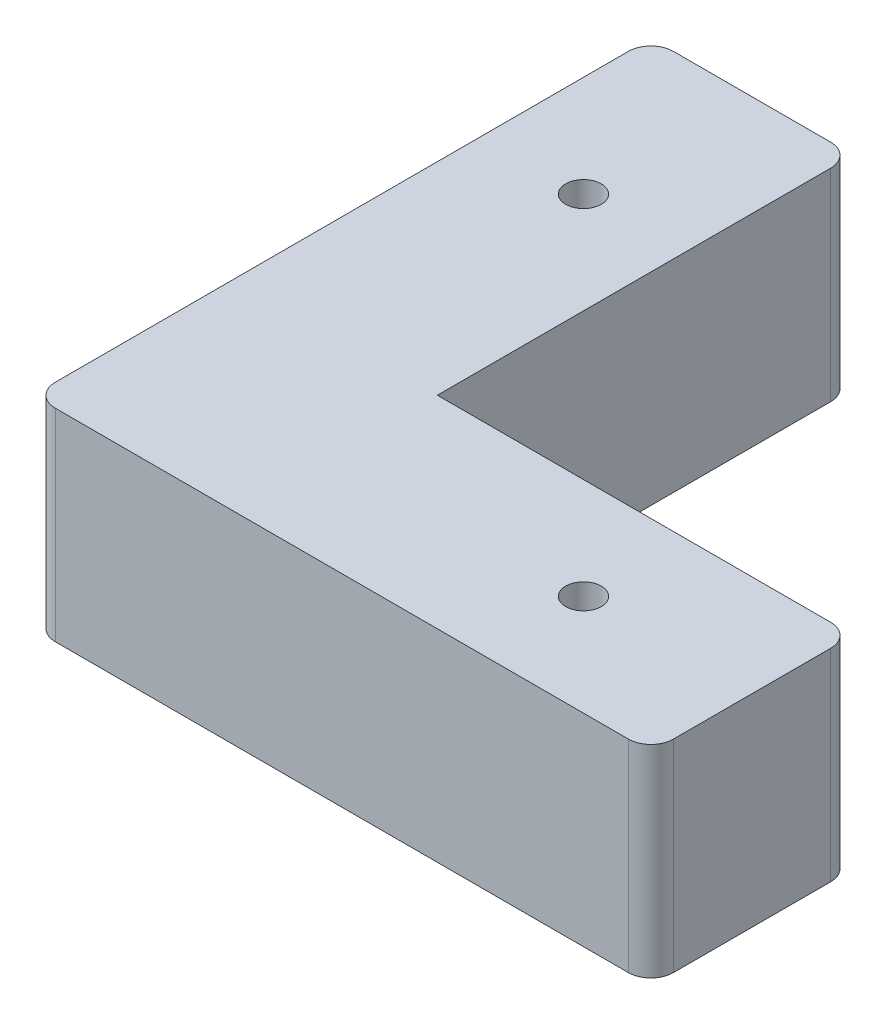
ISO-10303-21;
HEADER;
FILE_DESCRIPTION(('STEP AP214'),'2;1');
FILE_NAME('part.step','',(''),(''),'','','');
FILE_SCHEMA(('AUTOMOTIVE_DESIGN { 1 0 10303 214 1 1 1 1 }'));
ENDSEC;
DATA;
#1=APPLICATION_CONTEXT('core data for automotive mechanical design processes');
#2=APPLICATION_PROTOCOL_DEFINITION('international standard','automotive_design',2000,#1);
#3=PRODUCT_CONTEXT('',#1,'mechanical');
#4=PRODUCT('Part','Part','',(#3));
#5=PRODUCT_RELATED_PRODUCT_CATEGORY('part','',(#4));
#6=PRODUCT_DEFINITION_FORMATION('','',#4);
#7=PRODUCT_DEFINITION_CONTEXT('part definition',#1,'design');
#8=PRODUCT_DEFINITION('design','',#6,#7);
#9=PRODUCT_DEFINITION_SHAPE('','',#8);
#10=(LENGTH_UNIT() NAMED_UNIT(*) SI_UNIT(.MILLI.,.METRE.));
#11=(NAMED_UNIT(*) PLANE_ANGLE_UNIT() SI_UNIT($,.RADIAN.));
#12=(NAMED_UNIT(*) SI_UNIT($,.STERADIAN.) SOLID_ANGLE_UNIT());
#13=UNCERTAINTY_MEASURE_WITH_UNIT(LENGTH_MEASURE(1.E-05),#10,'distance_accuracy_value','');
#14=(GEOMETRIC_REPRESENTATION_CONTEXT(3) GLOBAL_UNCERTAINTY_ASSIGNED_CONTEXT((#13)) GLOBAL_UNIT_ASSIGNED_CONTEXT((#10,
#11,#12)) REPRESENTATION_CONTEXT('',''));
#15=CARTESIAN_POINT('',(0.,0.,0.));
#16=DIRECTION('',(0.,0.,1.));
#17=DIRECTION('',(1.,0.,0.));
#18=AXIS2_PLACEMENT_3D('',#15,#16,#17);
#19=CARTESIAN_POINT('',(0.,9.,0.));
#20=DIRECTION('',(0.,1.,0.));
#21=DIRECTION('',(0.,0.,1.));
#22=AXIS2_PLACEMENT_3D('',#19,#20,#21);
#23=PLANE('',#22);
#24=CARTESIAN_POINT('',(9.,9.,-40.));
#25=DIRECTION('',(0.,1.,0.));
#26=DIRECTION('',(0.,0.,1.));
#27=AXIS2_PLACEMENT_3D('',#24,#25,#26);
#28=CIRCLE('',#27,1.585);
#29=CARTESIAN_POINT('',(9.,9.,-38.415));
#30=VERTEX_POINT('',#29);
#31=EDGE_CURVE('E142',#30,#30,#28,.T.);
#32=ORIENTED_EDGE('',*,*,#31,.F.);
#33=EDGE_LOOP('',(#32));
#34=FACE_BOUND('',#33,.T.);
#35=DIRECTION('',(-1.,0.,0.));
#36=VECTOR('',#35,1.);
#37=CARTESIAN_POINT('',(18.,9.,-55.));
#38=LINE('',#37,#36);
#39=CARTESIAN_POINT('',(16.,9.,-55.));
#40=VERTEX_POINT('',#39);
#41=CARTESIAN_POINT('',(2.,9.,-55.));
#42=VERTEX_POINT('',#41);
#43=EDGE_CURVE('E153',#40,#42,#38,.T.);
#44=ORIENTED_EDGE('',*,*,#43,.T.);
#45=CARTESIAN_POINT('',(2.,9.,-53.));
#46=DIRECTION('',(0.,1.,0.));
#47=DIRECTION('',(0.,0.,1.));
#48=AXIS2_PLACEMENT_3D('',#45,#46,#47);
#49=CIRCLE('',#48,2.);
#50=CARTESIAN_POINT('',(0.,9.,-53.));
#51=VERTEX_POINT('',#50);
#52=EDGE_CURVE('E181',#42,#51,#49,.T.);
#53=ORIENTED_EDGE('',*,*,#52,.T.);
#54=DIRECTION('',(0.,0.,1.));
#55=VECTOR('',#54,1.);
#56=CARTESIAN_POINT('',(0.,9.,-55.));
#57=LINE('',#56,#55);
#58=CARTESIAN_POINT('',(0.,9.,-2.));
#59=VERTEX_POINT('',#58);
#60=EDGE_CURVE('E214',#51,#59,#57,.T.);
#61=ORIENTED_EDGE('',*,*,#60,.T.);
#62=CARTESIAN_POINT('',(2.,9.,-2.));
#63=DIRECTION('',(0.,1.,0.));
#64=DIRECTION('',(0.,0.,1.));
#65=AXIS2_PLACEMENT_3D('',#62,#63,#64);
#66=CIRCLE('',#65,2.);
#67=CARTESIAN_POINT('',(2.,9.,0.));
#68=VERTEX_POINT('',#67);
#69=EDGE_CURVE('E174',#59,#68,#66,.T.);
#70=ORIENTED_EDGE('',*,*,#69,.T.);
#71=DIRECTION('',(1.,0.,0.));
#72=VECTOR('',#71,1.);
#73=CARTESIAN_POINT('',(0.,9.,0.));
#74=LINE('',#73,#72);
#75=CARTESIAN_POINT('',(53.,9.,0.));
#76=VERTEX_POINT('',#75);
#77=EDGE_CURVE('E198',#68,#76,#74,.T.);
#78=ORIENTED_EDGE('',*,*,#77,.T.);
#79=CARTESIAN_POINT('',(53.,9.,-2.));
#80=DIRECTION('',(0.,1.,0.));
#81=DIRECTION('',(0.,0.,1.));
#82=AXIS2_PLACEMENT_3D('',#79,#80,#81);
#83=CIRCLE('',#82,2.);
#84=CARTESIAN_POINT('',(55.,9.,-2.));
#85=VERTEX_POINT('',#84);
#86=EDGE_CURVE('E176',#76,#85,#83,.T.);
#87=ORIENTED_EDGE('',*,*,#86,.T.);
#88=DIRECTION('',(0.,0.,-1.));
#89=VECTOR('',#88,1.);
#90=CARTESIAN_POINT('',(55.,9.,0.));
#91=LINE('',#90,#89);
#92=CARTESIAN_POINT('',(55.,9.,-16.));
#93=VERTEX_POINT('',#92);
#94=EDGE_CURVE('E124',#85,#93,#91,.T.);
#95=ORIENTED_EDGE('',*,*,#94,.T.);
#96=CARTESIAN_POINT('',(53.,9.,-16.));
#97=DIRECTION('',(0.,1.,0.));
#98=DIRECTION('',(0.,0.,1.));
#99=AXIS2_PLACEMENT_3D('',#96,#97,#98);
#100=CIRCLE('',#99,2.);
#101=CARTESIAN_POINT('',(53.,9.,-18.));
#102=VERTEX_POINT('',#101);
#103=EDGE_CURVE('E56',#93,#102,#100,.T.);
#104=ORIENTED_EDGE('',*,*,#103,.T.);
#105=DIRECTION('',(-1.,0.,0.));
#106=VECTOR('',#105,1.);
#107=CARTESIAN_POINT('',(55.,9.,-18.));
#108=LINE('',#107,#106);
#109=CARTESIAN_POINT('',(18.,9.,-18.));
#110=VERTEX_POINT('',#109);
#111=EDGE_CURVE('E115',#102,#110,#108,.T.);
#112=ORIENTED_EDGE('',*,*,#111,.T.);
#113=DIRECTION('',(0.,0.,-1.));
#114=VECTOR('',#113,1.);
#115=CARTESIAN_POINT('',(18.,9.,-18.));
#116=LINE('',#115,#114);
#117=CARTESIAN_POINT('',(18.,9.,-53.));
#118=VERTEX_POINT('',#117);
#119=EDGE_CURVE('E119',#110,#118,#116,.T.);
#120=ORIENTED_EDGE('',*,*,#119,.T.);
#121=CARTESIAN_POINT('',(16.,9.,-53.));
#122=DIRECTION('',(0.,1.,0.));
#123=DIRECTION('',(0.,0.,1.));
#124=AXIS2_PLACEMENT_3D('',#121,#122,#123);
#125=CIRCLE('',#124,2.);
#126=EDGE_CURVE('E179',#118,#40,#125,.T.);
#127=ORIENTED_EDGE('',*,*,#126,.T.);
#128=EDGE_LOOP('',(#44,#53,#61,#70,#78,#87,#95,#104,#112,#120,#127));
#129=FACE_BOUND('',#128,.T.);
#130=CARTESIAN_POINT('',(40.,9.,-9.));
#131=DIRECTION('',(0.,1.,0.));
#132=DIRECTION('',(0.,0.,1.));
#133=AXIS2_PLACEMENT_3D('',#130,#131,#132);
#134=CIRCLE('',#133,1.585);
#135=CARTESIAN_POINT('',(40.,9.,-7.415));
#136=VERTEX_POINT('',#135);
#137=EDGE_CURVE('E223',#136,#136,#134,.T.);
#138=ORIENTED_EDGE('',*,*,#137,.F.);
#139=EDGE_LOOP('',(#138));
#140=FACE_BOUND('',#139,.T.);
#141=ADVANCED_FACE('F33',(#34,#129,#140),#23,.T.);
#142=CARTESIAN_POINT('',(0.,-9.,0.));
#143=DIRECTION('',(0.,1.,0.));
#144=DIRECTION('',(0.,0.,1.));
#145=AXIS2_PLACEMENT_3D('',#142,#143,#144);
#146=PLANE('',#145);
#147=DIRECTION('',(0.,0.,1.));
#148=VECTOR('',#147,1.);
#149=CARTESIAN_POINT('',(0.,-9.,-55.));
#150=LINE('',#149,#148);
#151=CARTESIAN_POINT('',(0.,-9.,-53.));
#152=VERTEX_POINT('',#151);
#153=CARTESIAN_POINT('',(0.,-9.,-2.));
#154=VERTEX_POINT('',#153);
#155=EDGE_CURVE('E141',#152,#154,#150,.T.);
#156=ORIENTED_EDGE('',*,*,#155,.F.);
#157=CARTESIAN_POINT('',(2.,-9.,-53.));
#158=DIRECTION('',(0.,1.,0.));
#159=DIRECTION('',(0.,0.,1.));
#160=AXIS2_PLACEMENT_3D('',#157,#158,#159);
#161=CIRCLE('',#160,2.);
#162=CARTESIAN_POINT('',(2.,-9.,-55.));
#163=VERTEX_POINT('',#162);
#164=EDGE_CURVE('E167',#152,#163,#161,.F.);
#165=ORIENTED_EDGE('',*,*,#164,.T.);
#166=DIRECTION('',(-1.,0.,0.));
#167=VECTOR('',#166,1.);
#168=CARTESIAN_POINT('',(18.,-9.,-55.));
#169=LINE('',#168,#167);
#170=CARTESIAN_POINT('',(16.,-9.,-55.));
#171=VERTEX_POINT('',#170);
#172=EDGE_CURVE('E138',#171,#163,#169,.T.);
#173=ORIENTED_EDGE('',*,*,#172,.F.);
#174=CARTESIAN_POINT('',(16.,-9.,-53.));
#175=DIRECTION('',(0.,1.,0.));
#176=DIRECTION('',(0.,0.,1.));
#177=AXIS2_PLACEMENT_3D('',#174,#175,#176);
#178=CIRCLE('',#177,2.);
#179=CARTESIAN_POINT('',(18.,-9.,-53.));
#180=VERTEX_POINT('',#179);
#181=EDGE_CURVE('E165',#171,#180,#178,.F.);
#182=ORIENTED_EDGE('',*,*,#181,.T.);
#183=DIRECTION('',(0.,0.,-1.));
#184=VECTOR('',#183,1.);
#185=CARTESIAN_POINT('',(18.,-9.,-18.));
#186=LINE('',#185,#184);
#187=CARTESIAN_POINT('',(18.,-9.,-18.));
#188=VERTEX_POINT('',#187);
#189=EDGE_CURVE('E152',#188,#180,#186,.T.);
#190=ORIENTED_EDGE('',*,*,#189,.F.);
#191=DIRECTION('',(-1.,0.,0.));
#192=VECTOR('',#191,1.);
#193=CARTESIAN_POINT('',(55.,-9.,-18.));
#194=LINE('',#193,#192);
#195=CARTESIAN_POINT('',(53.,-9.,-18.));
#196=VERTEX_POINT('',#195);
#197=EDGE_CURVE('E130',#196,#188,#194,.T.);
#198=ORIENTED_EDGE('',*,*,#197,.F.);
#199=CARTESIAN_POINT('',(53.,-9.,-16.));
#200=DIRECTION('',(0.,1.,0.));
#201=DIRECTION('',(0.,0.,1.));
#202=AXIS2_PLACEMENT_3D('',#199,#200,#201);
#203=CIRCLE('',#202,2.);
#204=CARTESIAN_POINT('',(55.,-9.,-16.));
#205=VERTEX_POINT('',#204);
#206=EDGE_CURVE('E163',#196,#205,#203,.F.);
#207=ORIENTED_EDGE('',*,*,#206,.T.);
#208=DIRECTION('',(0.,0.,-1.));
#209=VECTOR('',#208,1.);
#210=CARTESIAN_POINT('',(55.,-9.,0.));
#211=LINE('',#210,#209);
#212=CARTESIAN_POINT('',(55.,-9.,-2.));
#213=VERTEX_POINT('',#212);
#214=EDGE_CURVE('E148',#213,#205,#211,.T.);
#215=ORIENTED_EDGE('',*,*,#214,.F.);
#216=CARTESIAN_POINT('',(53.,-9.,-2.));
#217=DIRECTION('',(0.,1.,0.));
#218=DIRECTION('',(0.,0.,1.));
#219=AXIS2_PLACEMENT_3D('',#216,#217,#218);
#220=CIRCLE('',#219,2.);
#221=CARTESIAN_POINT('',(53.,-9.,0.));
#222=VERTEX_POINT('',#221);
#223=EDGE_CURVE('E161',#213,#222,#220,.F.);
#224=ORIENTED_EDGE('',*,*,#223,.T.);
#225=DIRECTION('',(1.,0.,0.));
#226=VECTOR('',#225,1.);
#227=CARTESIAN_POINT('',(0.,-9.,0.));
#228=LINE('',#227,#226);
#229=CARTESIAN_POINT('',(2.,-9.,0.));
#230=VERTEX_POINT('',#229);
#231=EDGE_CURVE('E145',#230,#222,#228,.T.);
#232=ORIENTED_EDGE('',*,*,#231,.F.);
#233=CARTESIAN_POINT('',(2.,-9.,-2.));
#234=DIRECTION('',(0.,1.,0.));
#235=DIRECTION('',(0.,0.,1.));
#236=AXIS2_PLACEMENT_3D('',#233,#234,#235);
#237=CIRCLE('',#236,2.);
#238=EDGE_CURVE('E159',#230,#154,#237,.F.);
#239=ORIENTED_EDGE('',*,*,#238,.T.);
#240=EDGE_LOOP('',(#156,#165,#173,#182,#190,#198,#207,#215,#224,#232,#239));
#241=FACE_BOUND('',#240,.T.);
#242=CARTESIAN_POINT('',(9.,-9.,-40.));
#243=DIRECTION('',(0.,1.,0.));
#244=DIRECTION('',(0.,0.,1.));
#245=AXIS2_PLACEMENT_3D('',#242,#243,#244);
#246=CIRCLE('',#245,1.585);
#247=CARTESIAN_POINT('',(9.,-9.,-38.415));
#248=VERTEX_POINT('',#247);
#249=EDGE_CURVE('E220',#248,#248,#246,.T.);
#250=ORIENTED_EDGE('',*,*,#249,.T.);
#251=EDGE_LOOP('',(#250));
#252=FACE_BOUND('',#251,.T.);
#253=CARTESIAN_POINT('',(40.,-9.,-9.));
#254=DIRECTION('',(0.,1.,0.));
#255=DIRECTION('',(0.,0.,1.));
#256=AXIS2_PLACEMENT_3D('',#253,#254,#255);
#257=CIRCLE('',#256,1.585);
#258=CARTESIAN_POINT('',(40.,-9.,-7.415));
#259=VERTEX_POINT('',#258);
#260=EDGE_CURVE('E226',#259,#259,#257,.T.);
#261=ORIENTED_EDGE('',*,*,#260,.T.);
#262=EDGE_LOOP('',(#261));
#263=FACE_BOUND('',#262,.T.);
#264=ADVANCED_FACE('F203',(#241,#252,#263),#146,.F.);
#265=CARTESIAN_POINT('',(18.,9.,-55.));
#266=DIRECTION('',(0.,0.,1.));
#267=DIRECTION('',(1.,0.,0.));
#268=AXIS2_PLACEMENT_3D('',#265,#266,#267);
#269=PLANE('',#268);
#270=ORIENTED_EDGE('',*,*,#172,.T.);
#271=DIRECTION('',(0.,-1.,0.));
#272=VECTOR('',#271,1.);
#273=CARTESIAN_POINT('',(2.,9.,-55.));
#274=LINE('',#273,#272);
#275=EDGE_CURVE('E172',#163,#42,#274,.F.);
#276=ORIENTED_EDGE('',*,*,#275,.T.);
#277=ORIENTED_EDGE('',*,*,#43,.F.);
#278=DIRECTION('',(0.,-1.,0.));
#279=VECTOR('',#278,1.);
#280=CARTESIAN_POINT('',(16.,9.,-55.));
#281=LINE('',#280,#279);
#282=EDGE_CURVE('E169',#40,#171,#281,.T.);
#283=ORIENTED_EDGE('',*,*,#282,.T.);
#284=EDGE_LOOP('',(#270,#276,#277,#283));
#285=FACE_BOUND('',#284,.T.);
#286=ADVANCED_FACE('F240',(#285),#269,.F.);
#287=CARTESIAN_POINT('',(0.,9.,-55.));
#288=DIRECTION('',(1.,0.,0.));
#289=DIRECTION('',(0.,0.,-1.));
#290=AXIS2_PLACEMENT_3D('',#287,#288,#289);
#291=PLANE('',#290);
#292=ORIENTED_EDGE('',*,*,#60,.F.);
#293=DIRECTION('',(0.,-1.,0.));
#294=VECTOR('',#293,1.);
#295=CARTESIAN_POINT('',(0.,9.,-53.));
#296=LINE('',#295,#294);
#297=EDGE_CURVE('E156',#51,#152,#296,.T.);
#298=ORIENTED_EDGE('',*,*,#297,.T.);
#299=ORIENTED_EDGE('',*,*,#155,.T.);
#300=DIRECTION('',(0.,-1.,0.));
#301=VECTOR('',#300,1.);
#302=CARTESIAN_POINT('',(0.,9.,-2.));
#303=LINE('',#302,#301);
#304=EDGE_CURVE('E132',#154,#59,#303,.F.);
#305=ORIENTED_EDGE('',*,*,#304,.T.);
#306=EDGE_LOOP('',(#292,#298,#299,#305));
#307=FACE_BOUND('',#306,.T.);
#308=ADVANCED_FACE('F255',(#307),#291,.F.);
#309=CARTESIAN_POINT('',(0.,9.,0.));
#310=DIRECTION('',(0.,0.,-1.));
#311=DIRECTION('',(-1.,0.,0.));
#312=AXIS2_PLACEMENT_3D('',#309,#310,#311);
#313=PLANE('',#312);
#314=ORIENTED_EDGE('',*,*,#231,.T.);
#315=DIRECTION('',(0.,-1.,0.));
#316=VECTOR('',#315,1.);
#317=CARTESIAN_POINT('',(53.,9.,0.));
#318=LINE('',#317,#316);
#319=EDGE_CURVE('E11',#222,#76,#318,.F.);
#320=ORIENTED_EDGE('',*,*,#319,.T.);
#321=ORIENTED_EDGE('',*,*,#77,.F.);
#322=DIRECTION('',(0.,-1.,0.));
#323=VECTOR('',#322,1.);
#324=CARTESIAN_POINT('',(2.,9.,0.));
#325=LINE('',#324,#323);
#326=EDGE_CURVE('E41',#68,#230,#325,.T.);
#327=ORIENTED_EDGE('',*,*,#326,.T.);
#328=EDGE_LOOP('',(#314,#320,#321,#327));
#329=FACE_BOUND('',#328,.T.);
#330=ADVANCED_FACE('F195',(#329),#313,.F.);
#331=CARTESIAN_POINT('',(55.,9.,0.));
#332=DIRECTION('',(-1.,0.,0.));
#333=DIRECTION('',(0.,0.,1.));
#334=AXIS2_PLACEMENT_3D('',#331,#332,#333);
#335=PLANE('',#334);
#336=ORIENTED_EDGE('',*,*,#214,.T.);
#337=DIRECTION('',(0.,-1.,0.));
#338=VECTOR('',#337,1.);
#339=CARTESIAN_POINT('',(55.,9.,-16.));
#340=LINE('',#339,#338);
#341=EDGE_CURVE('E189',#205,#93,#340,.F.);
#342=ORIENTED_EDGE('',*,*,#341,.T.);
#343=ORIENTED_EDGE('',*,*,#94,.F.);
#344=DIRECTION('',(0.,-1.,0.));
#345=VECTOR('',#344,1.);
#346=CARTESIAN_POINT('',(55.,9.,-2.));
#347=LINE('',#346,#345);
#348=EDGE_CURVE('E186',#85,#213,#347,.T.);
#349=ORIENTED_EDGE('',*,*,#348,.T.);
#350=EDGE_LOOP('',(#336,#342,#343,#349));
#351=FACE_BOUND('',#350,.T.);
#352=ADVANCED_FACE('F212',(#351),#335,.F.);
#353=CARTESIAN_POINT('',(55.,9.,-18.));
#354=DIRECTION('',(0.,0.,1.));
#355=DIRECTION('',(1.,0.,0.));
#356=AXIS2_PLACEMENT_3D('',#353,#354,#355);
#357=PLANE('',#356);
#358=ORIENTED_EDGE('',*,*,#111,.F.);
#359=DIRECTION('',(0.,-1.,0.));
#360=VECTOR('',#359,1.);
#361=CARTESIAN_POINT('',(53.,9.,-18.));
#362=LINE('',#361,#360);
#363=EDGE_CURVE('E184',#102,#196,#362,.T.);
#364=ORIENTED_EDGE('',*,*,#363,.T.);
#365=ORIENTED_EDGE('',*,*,#197,.T.);
#366=DIRECTION('',(0.,-1.,0.));
#367=VECTOR('',#366,1.);
#368=CARTESIAN_POINT('',(18.,9.,-18.));
#369=LINE('',#368,#367);
#370=EDGE_CURVE('E127',#110,#188,#369,.T.);
#371=ORIENTED_EDGE('',*,*,#370,.F.);
#372=EDGE_LOOP('',(#358,#364,#365,#371));
#373=FACE_BOUND('',#372,.T.);
#374=ADVANCED_FACE('F128',(#373),#357,.F.);
#375=CARTESIAN_POINT('',(18.,9.,-18.));
#376=DIRECTION('',(-1.,0.,0.));
#377=DIRECTION('',(0.,0.,1.));
#378=AXIS2_PLACEMENT_3D('',#375,#376,#377);
#379=PLANE('',#378);
#380=ORIENTED_EDGE('',*,*,#189,.T.);
#381=DIRECTION('',(0.,-1.,0.));
#382=VECTOR('',#381,1.);
#383=CARTESIAN_POINT('',(18.,9.,-53.));
#384=LINE('',#383,#382);
#385=EDGE_CURVE('E48',#180,#118,#384,.F.);
#386=ORIENTED_EDGE('',*,*,#385,.T.);
#387=ORIENTED_EDGE('',*,*,#119,.F.);
#388=ORIENTED_EDGE('',*,*,#370,.T.);
#389=EDGE_LOOP('',(#380,#386,#387,#388));
#390=FACE_BOUND('',#389,.T.);
#391=ADVANCED_FACE('F134',(#390),#379,.F.);
#392=CARTESIAN_POINT('',(9.,9.,-40.));
#393=DIRECTION('',(0.,-1.,0.));
#394=DIRECTION('',(0.,0.,-1.));
#395=AXIS2_PLACEMENT_3D('',#392,#393,#394);
#396=CYLINDRICAL_SURFACE('',#395,1.585);
#397=ORIENTED_EDGE('',*,*,#31,.T.);
#398=EDGE_LOOP('',(#397));
#399=FACE_BOUND('',#398,.T.);
#400=ORIENTED_EDGE('',*,*,#249,.F.);
#401=EDGE_LOOP('',(#400));
#402=FACE_BOUND('',#401,.T.);
#403=ADVANCED_FACE('F244',(#399,#402),#396,.F.);
#404=CARTESIAN_POINT('',(40.,9.,-9.));
#405=DIRECTION('',(0.,-1.,0.));
#406=DIRECTION('',(0.,0.,-1.));
#407=AXIS2_PLACEMENT_3D('',#404,#405,#406);
#408=CYLINDRICAL_SURFACE('',#407,1.585);
#409=ORIENTED_EDGE('',*,*,#137,.T.);
#410=EDGE_LOOP('',(#409));
#411=FACE_BOUND('',#410,.T.);
#412=ORIENTED_EDGE('',*,*,#260,.F.);
#413=EDGE_LOOP('',(#412));
#414=FACE_BOUND('',#413,.T.);
#415=ADVANCED_FACE('F232',(#411,#414),#408,.F.);
#416=CARTESIAN_POINT('',(2.,9.,-53.));
#417=DIRECTION('',(0.,-1.,0.));
#418=DIRECTION('',(0.,0.,-1.));
#419=AXIS2_PLACEMENT_3D('',#416,#417,#418);
#420=CYLINDRICAL_SURFACE('',#419,2.);
#421=ORIENTED_EDGE('',*,*,#52,.F.);
#422=ORIENTED_EDGE('',*,*,#275,.F.);
#423=ORIENTED_EDGE('',*,*,#164,.F.);
#424=ORIENTED_EDGE('',*,*,#297,.F.);
#425=EDGE_LOOP('',(#421,#422,#423,#424));
#426=FACE_BOUND('',#425,.T.);
#427=ADVANCED_FACE('F262',(#426),#420,.T.);
#428=CARTESIAN_POINT('',(16.,9.,-53.));
#429=DIRECTION('',(0.,-1.,0.));
#430=DIRECTION('',(0.,0.,-1.));
#431=AXIS2_PLACEMENT_3D('',#428,#429,#430);
#432=CYLINDRICAL_SURFACE('',#431,2.);
#433=ORIENTED_EDGE('',*,*,#126,.F.);
#434=ORIENTED_EDGE('',*,*,#385,.F.);
#435=ORIENTED_EDGE('',*,*,#181,.F.);
#436=ORIENTED_EDGE('',*,*,#282,.F.);
#437=EDGE_LOOP('',(#433,#434,#435,#436));
#438=FACE_BOUND('',#437,.T.);
#439=ADVANCED_FACE('F265',(#438),#432,.T.);
#440=CARTESIAN_POINT('',(53.,9.,-16.));
#441=DIRECTION('',(0.,-1.,0.));
#442=DIRECTION('',(0.,0.,-1.));
#443=AXIS2_PLACEMENT_3D('',#440,#441,#442);
#444=CYLINDRICAL_SURFACE('',#443,2.);
#445=ORIENTED_EDGE('',*,*,#103,.F.);
#446=ORIENTED_EDGE('',*,*,#341,.F.);
#447=ORIENTED_EDGE('',*,*,#206,.F.);
#448=ORIENTED_EDGE('',*,*,#363,.F.);
#449=EDGE_LOOP('',(#445,#446,#447,#448));
#450=FACE_BOUND('',#449,.T.);
#451=ADVANCED_FACE('F269',(#450),#444,.T.);
#452=CARTESIAN_POINT('',(53.,9.,-2.));
#453=DIRECTION('',(0.,-1.,0.));
#454=DIRECTION('',(0.,0.,-1.));
#455=AXIS2_PLACEMENT_3D('',#452,#453,#454);
#456=CYLINDRICAL_SURFACE('',#455,2.);
#457=ORIENTED_EDGE('',*,*,#86,.F.);
#458=ORIENTED_EDGE('',*,*,#319,.F.);
#459=ORIENTED_EDGE('',*,*,#223,.F.);
#460=ORIENTED_EDGE('',*,*,#348,.F.);
#461=EDGE_LOOP('',(#457,#458,#459,#460));
#462=FACE_BOUND('',#461,.T.);
#463=ADVANCED_FACE('F209',(#462),#456,.T.);
#464=CARTESIAN_POINT('',(2.,9.,-2.));
#465=DIRECTION('',(0.,-1.,0.));
#466=DIRECTION('',(0.,0.,-1.));
#467=AXIS2_PLACEMENT_3D('',#464,#465,#466);
#468=CYLINDRICAL_SURFACE('',#467,2.);
#469=ORIENTED_EDGE('',*,*,#69,.F.);
#470=ORIENTED_EDGE('',*,*,#304,.F.);
#471=ORIENTED_EDGE('',*,*,#238,.F.);
#472=ORIENTED_EDGE('',*,*,#326,.F.);
#473=EDGE_LOOP('',(#469,#470,#471,#472));
#474=FACE_BOUND('',#473,.T.);
#475=ADVANCED_FACE('F35',(#474),#468,.T.);
#476=CLOSED_SHELL('',(#141,#264,#286,#308,#330,#352,#374,#391,#403,#415,#427,#439,#451,#463,#475));
#477=MANIFOLD_SOLID_BREP('B2',#476);
#478=ADVANCED_BREP_SHAPE_REPRESENTATION('',(#18,#477),#14);
#479=SHAPE_DEFINITION_REPRESENTATION(#9,#478);
ENDSEC;
END-ISO-10303-21;
